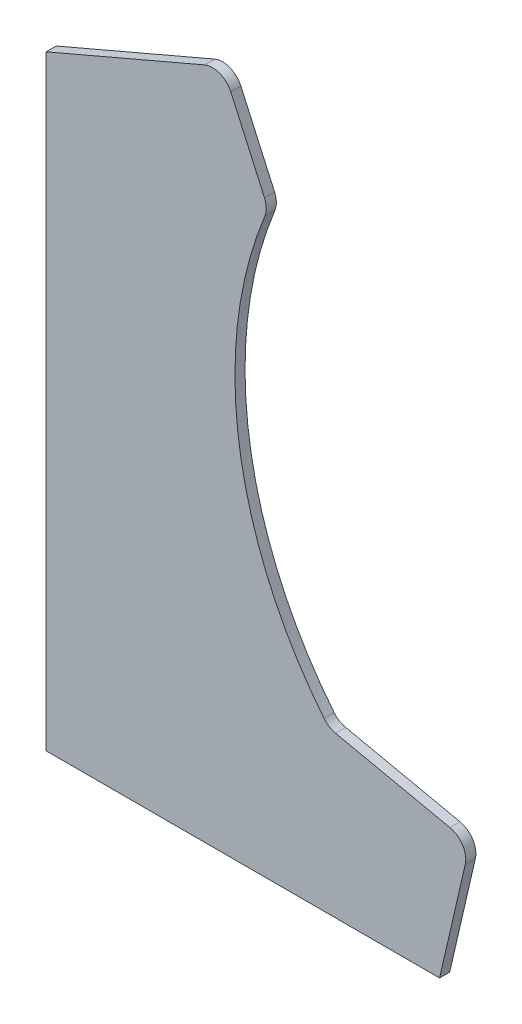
ISO-10303-21;
HEADER;
FILE_DESCRIPTION(('STEP AP214'),'2;1');
FILE_NAME('part.step','',(''),(''),'','','');
FILE_SCHEMA(('AUTOMOTIVE_DESIGN { 1 0 10303 214 1 1 1 1 }'));
ENDSEC;
DATA;
#1=APPLICATION_CONTEXT('core data for automotive mechanical design processes');
#2=APPLICATION_PROTOCOL_DEFINITION('international standard','automotive_design',2000,#1);
#3=PRODUCT_CONTEXT('',#1,'mechanical');
#4=PRODUCT('Part','Part','',(#3));
#5=PRODUCT_RELATED_PRODUCT_CATEGORY('part','',(#4));
#6=PRODUCT_DEFINITION_FORMATION('','',#4);
#7=PRODUCT_DEFINITION_CONTEXT('part definition',#1,'design');
#8=PRODUCT_DEFINITION('design','',#6,#7);
#9=PRODUCT_DEFINITION_SHAPE('','',#8);
#10=(LENGTH_UNIT() NAMED_UNIT(*) SI_UNIT(.MILLI.,.METRE.));
#11=(NAMED_UNIT(*) PLANE_ANGLE_UNIT() SI_UNIT($,.RADIAN.));
#12=(NAMED_UNIT(*) SI_UNIT($,.STERADIAN.) SOLID_ANGLE_UNIT());
#13=UNCERTAINTY_MEASURE_WITH_UNIT(LENGTH_MEASURE(1.E-05),#10,'distance_accuracy_value','');
#14=(GEOMETRIC_REPRESENTATION_CONTEXT(3) GLOBAL_UNCERTAINTY_ASSIGNED_CONTEXT((#13)) GLOBAL_UNIT_ASSIGNED_CONTEXT((#10,
#11,#12)) REPRESENTATION_CONTEXT('',''));
#15=CARTESIAN_POINT('',(0.,0.,0.));
#16=DIRECTION('',(0.,0.,1.));
#17=DIRECTION('',(1.,0.,0.));
#18=AXIS2_PLACEMENT_3D('',#15,#16,#17);
#19=CARTESIAN_POINT('',(390.,0.,10.));
#20=DIRECTION('',(0.,-1.,0.));
#21=DIRECTION('',(1.,0.,0.));
#22=AXIS2_PLACEMENT_3D('',#19,#20,#21);
#23=PLANE('',#22);
#24=DIRECTION('',(-1.,0.,0.));
#25=VECTOR('',#24,1.);
#26=CARTESIAN_POINT('',(390.,0.,0.));
#27=LINE('',#26,#25);
#28=CARTESIAN_POINT('',(390.,0.,0.));
#29=VERTEX_POINT('',#28);
#30=CARTESIAN_POINT('',(0.,0.,0.));
#31=VERTEX_POINT('',#30);
#32=EDGE_CURVE('E159',#29,#31,#27,.T.);
#33=ORIENTED_EDGE('',*,*,#32,.F.);
#34=DIRECTION('',(0.,0.,-1.));
#35=VECTOR('',#34,1.);
#36=CARTESIAN_POINT('',(390.,0.,10.));
#37=LINE('',#36,#35);
#38=CARTESIAN_POINT('',(390.,0.,10.));
#39=VERTEX_POINT('',#38);
#40=EDGE_CURVE('E13',#39,#29,#37,.T.);
#41=ORIENTED_EDGE('',*,*,#40,.F.);
#42=DIRECTION('',(-1.,0.,0.));
#43=VECTOR('',#42,1.);
#44=CARTESIAN_POINT('',(390.,0.,10.));
#45=LINE('',#44,#43);
#46=CARTESIAN_POINT('',(0.,0.,10.));
#47=VERTEX_POINT('',#46);
#48=EDGE_CURVE('E186',#39,#47,#45,.T.);
#49=ORIENTED_EDGE('',*,*,#48,.T.);
#50=DIRECTION('',(0.,0.,-1.));
#51=VECTOR('',#50,1.);
#52=CARTESIAN_POINT('',(0.,0.,10.));
#53=LINE('',#52,#51);
#54=EDGE_CURVE('E45',#47,#31,#53,.T.);
#55=ORIENTED_EDGE('',*,*,#54,.T.);
#56=EDGE_LOOP('',(#33,#41,#49,#55));
#57=FACE_BOUND('',#56,.T.);
#58=ADVANCED_FACE('F42',(#57),#23,.T.);
#59=CARTESIAN_POINT('',(390.,0.,10.));
#60=DIRECTION('',(-0.97439119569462,0.224859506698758,0.));
#61=DIRECTION('',(-0.224859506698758,-0.97439119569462,0.));
#62=AXIS2_PLACEMENT_3D('',#59,#60,#61);
#63=PLANE('',#62);
#64=DIRECTION('',(0.224859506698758,0.97439119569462,0.));
#65=VECTOR('',#64,1.);
#66=CARTESIAN_POINT('',(390.,0.,0.));
#67=LINE('',#66,#65);
#68=CARTESIAN_POINT('',(415.431618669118,110.20368089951,0.));
#69=VERTEX_POINT('',#68);
#70=EDGE_CURVE('E96',#29,#69,#67,.T.);
#71=ORIENTED_EDGE('',*,*,#70,.T.);
#72=DIRECTION('',(0.,0.,-1.));
#73=VECTOR('',#72,1.);
#74=CARTESIAN_POINT('',(415.431618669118,110.20368089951,10.));
#75=LINE('',#74,#73);
#76=CARTESIAN_POINT('',(415.431618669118,110.20368089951,10.));
#77=VERTEX_POINT('',#76);
#78=EDGE_CURVE('E51',#77,#69,#75,.T.);
#79=ORIENTED_EDGE('',*,*,#78,.F.);
#80=DIRECTION('',(0.224859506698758,0.97439119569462,0.));
#81=VECTOR('',#80,1.);
#82=CARTESIAN_POINT('',(390.,0.,10.));
#83=LINE('',#82,#81);
#84=EDGE_CURVE('E137',#39,#77,#83,.T.);
#85=ORIENTED_EDGE('',*,*,#84,.F.);
#86=ORIENTED_EDGE('',*,*,#40,.T.);
#87=EDGE_LOOP('',(#71,#79,#85,#86));
#88=FACE_BOUND('',#87,.T.);
#89=ADVANCED_FACE('F251',(#88),#63,.F.);
#90=CARTESIAN_POINT('',(395.943794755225,114.700871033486,10.));
#91=DIRECTION('',(0.,0.,-1.));
#92=DIRECTION('',(-1.,0.,0.));
#93=AXIS2_PLACEMENT_3D('',#90,#91,#92);
#94=CYLINDRICAL_SURFACE('',#93,20.);
#95=CARTESIAN_POINT('',(395.943794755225,114.700871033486,0.));
#96=DIRECTION('',(0.,0.,1.));
#97=DIRECTION('',(1.,0.,0.));
#98=AXIS2_PLACEMENT_3D('',#95,#96,#97);
#99=CIRCLE('',#98,20.);
#100=CARTESIAN_POINT('',(400.134376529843,134.256919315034,0.));
#101=VERTEX_POINT('',#100);
#102=EDGE_CURVE('E144',#69,#101,#99,.T.);
#103=ORIENTED_EDGE('',*,*,#102,.T.);
#104=DIRECTION('',(0.,0.,-1.));
#105=VECTOR('',#104,1.);
#106=CARTESIAN_POINT('',(400.134376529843,134.256919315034,10.));
#107=LINE('',#106,#105);
#108=CARTESIAN_POINT('',(400.134376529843,134.256919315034,10.));
#109=VERTEX_POINT('',#108);
#110=EDGE_CURVE('E141',#109,#101,#107,.T.);
#111=ORIENTED_EDGE('',*,*,#110,.F.);
#112=CARTESIAN_POINT('',(395.943794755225,114.700871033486,10.));
#113=DIRECTION('',(0.,0.,1.));
#114=DIRECTION('',(1.,0.,0.));
#115=AXIS2_PLACEMENT_3D('',#112,#113,#114);
#116=CIRCLE('',#115,20.);
#117=EDGE_CURVE('E129',#77,#109,#116,.T.);
#118=ORIENTED_EDGE('',*,*,#117,.F.);
#119=ORIENTED_EDGE('',*,*,#78,.T.);
#120=EDGE_LOOP('',(#103,#111,#118,#119));
#121=FACE_BOUND('',#120,.T.);
#122=ADVANCED_FACE('F142',(#121),#94,.T.);
#123=CARTESIAN_POINT('',(400.134376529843,134.256919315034,10.));
#124=DIRECTION('',(-0.209529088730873,-0.97780241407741,0.));
#125=DIRECTION('',(0.97780241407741,-0.209529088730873,0.));
#126=AXIS2_PLACEMENT_3D('',#123,#124,#125);
#127=PLANE('',#126);
#128=DIRECTION('',(-0.97780241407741,0.209529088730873,0.));
#129=VECTOR('',#128,1.);
#130=CARTESIAN_POINT('',(400.134376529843,134.256919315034,0.));
#131=LINE('',#130,#129);
#132=CARTESIAN_POINT('',(286.843759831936,158.533480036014,0.));
#133=VERTEX_POINT('',#132);
#134=EDGE_CURVE('E183',#101,#133,#131,.T.);
#135=ORIENTED_EDGE('',*,*,#134,.T.);
#136=DIRECTION('',(0.,0.,-1.));
#137=VECTOR('',#136,1.);
#138=CARTESIAN_POINT('',(286.843759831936,158.533480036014,10.));
#139=LINE('',#138,#137);
#140=CARTESIAN_POINT('',(286.843759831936,158.533480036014,10.));
#141=VERTEX_POINT('',#140);
#142=EDGE_CURVE('E148',#141,#133,#139,.T.);
#143=ORIENTED_EDGE('',*,*,#142,.F.);
#144=DIRECTION('',(-0.97780241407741,0.209529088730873,0.));
#145=VECTOR('',#144,1.);
#146=CARTESIAN_POINT('',(400.134376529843,134.256919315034,10.));
#147=LINE('',#146,#145);
#148=EDGE_CURVE('E135',#109,#141,#147,.T.);
#149=ORIENTED_EDGE('',*,*,#148,.F.);
#150=ORIENTED_EDGE('',*,*,#110,.T.);
#151=EDGE_LOOP('',(#135,#143,#149,#150));
#152=FACE_BOUND('',#151,.T.);
#153=ADVANCED_FACE('F150',(#152),#127,.F.);
#154=CARTESIAN_POINT('',(291.034341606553,178.089528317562,10.));
#155=DIRECTION('',(0.,0.,-1.));
#156=DIRECTION('',(-1.,0.,0.));
#157=AXIS2_PLACEMENT_3D('',#154,#155,#156);
#158=CYLINDRICAL_SURFACE('',#157,19.9999999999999);
#159=CARTESIAN_POINT('',(291.034341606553,178.089528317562,0.));
#160=DIRECTION('',(0.,0.,1.));
#161=DIRECTION('',(1.,0.,0.));
#162=AXIS2_PLACEMENT_3D('',#159,#160,#161);
#163=CIRCLE('',#162,19.9999999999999);
#164=CARTESIAN_POINT('',(275.449490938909,165.555078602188,0.));
#165=VERTEX_POINT('',#164);
#166=EDGE_CURVE('E180',#165,#133,#163,.T.);
#167=ORIENTED_EDGE('',*,*,#166,.F.);
#168=DIRECTION('',(0.,0.,-1.));
#169=VECTOR('',#168,1.);
#170=CARTESIAN_POINT('',(275.449490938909,165.555078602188,10.));
#171=LINE('',#170,#169);
#172=CARTESIAN_POINT('',(275.449490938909,165.555078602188,10.));
#173=VERTEX_POINT('',#172);
#174=EDGE_CURVE('E190',#173,#165,#171,.T.);
#175=ORIENTED_EDGE('',*,*,#174,.F.);
#176=CARTESIAN_POINT('',(291.034341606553,178.089528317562,10.));
#177=DIRECTION('',(0.,0.,1.));
#178=DIRECTION('',(1.,0.,0.));
#179=AXIS2_PLACEMENT_3D('',#176,#177,#178);
#180=CIRCLE('',#179,19.9999999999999);
#181=EDGE_CURVE('E152',#173,#141,#180,.T.);
#182=ORIENTED_EDGE('',*,*,#181,.T.);
#183=ORIENTED_EDGE('',*,*,#142,.T.);
#184=EDGE_LOOP('',(#167,#175,#182,#183));
#185=FACE_BOUND('',#184,.T.);
#186=ADVANCED_FACE('F207',(#185),#158,.F.);
#187=CARTESIAN_POINT('',(587.146504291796,416.244072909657,10.));
#188=DIRECTION('',(0.,0.,-1.));
#189=DIRECTION('',(-1.,0.,0.));
#190=AXIS2_PLACEMENT_3D('',#187,#188,#189);
#191=CYLINDRICAL_SURFACE('',#190,400.);
#192=CARTESIAN_POINT('',(587.146504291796,416.244072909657,0.));
#193=DIRECTION('',(0.,0.,1.));
#194=DIRECTION('',(1.,0.,0.));
#195=AXIS2_PLACEMENT_3D('',#192,#193,#194);
#196=CIRCLE('',#195,400.);
#197=CARTESIAN_POINT('',(216.714823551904,567.175745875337,0.));
#198=VERTEX_POINT('',#197);
#199=EDGE_CURVE('E177',#198,#165,#196,.T.);
#200=ORIENTED_EDGE('',*,*,#199,.F.);
#201=DIRECTION('',(0.,0.,-1.));
#202=VECTOR('',#201,1.);
#203=CARTESIAN_POINT('',(216.714823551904,567.175745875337,10.));
#204=LINE('',#203,#202);
#205=CARTESIAN_POINT('',(216.714823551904,567.175745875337,10.));
#206=VERTEX_POINT('',#205);
#207=EDGE_CURVE('E192',#206,#198,#204,.T.);
#208=ORIENTED_EDGE('',*,*,#207,.F.);
#209=CARTESIAN_POINT('',(587.146504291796,416.244072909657,10.));
#210=DIRECTION('',(0.,0.,1.));
#211=DIRECTION('',(1.,0.,0.));
#212=AXIS2_PLACEMENT_3D('',#209,#210,#211);
#213=CIRCLE('',#212,400.);
#214=EDGE_CURVE('E154',#206,#173,#213,.T.);
#215=ORIENTED_EDGE('',*,*,#214,.T.);
#216=ORIENTED_EDGE('',*,*,#174,.T.);
#217=EDGE_LOOP('',(#200,#208,#215,#216));
#218=FACE_BOUND('',#217,.T.);
#219=ADVANCED_FACE('F213',(#218),#191,.F.);
#220=CARTESIAN_POINT('',(198.193239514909,574.722329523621,10.));
#221=DIRECTION('',(0.,0.,-1.));
#222=DIRECTION('',(-1.,0.,0.));
#223=AXIS2_PLACEMENT_3D('',#220,#221,#222);
#224=CYLINDRICAL_SURFACE('',#223,20.);
#225=CARTESIAN_POINT('',(198.193239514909,574.722329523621,0.));
#226=DIRECTION('',(0.,0.,-1.));
#227=DIRECTION('',(-1.,0.,0.));
#228=AXIS2_PLACEMENT_3D('',#225,#226,#227);
#229=CIRCLE('',#228,20.);
#230=CARTESIAN_POINT('',(216.431669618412,582.929623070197,0.));
#231=VERTEX_POINT('',#230);
#232=EDGE_CURVE('E174',#231,#198,#229,.T.);
#233=ORIENTED_EDGE('',*,*,#232,.F.);
#234=DIRECTION('',(0.,0.,-1.));
#235=VECTOR('',#234,1.);
#236=CARTESIAN_POINT('',(216.431669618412,582.929623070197,10.));
#237=LINE('',#236,#235);
#238=CARTESIAN_POINT('',(216.431669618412,582.929623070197,10.));
#239=VERTEX_POINT('',#238);
#240=EDGE_CURVE('E194',#239,#231,#237,.T.);
#241=ORIENTED_EDGE('',*,*,#240,.F.);
#242=CARTESIAN_POINT('',(198.193239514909,574.722329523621,10.));
#243=DIRECTION('',(0.,0.,-1.));
#244=DIRECTION('',(-1.,0.,0.));
#245=AXIS2_PLACEMENT_3D('',#242,#243,#244);
#246=CIRCLE('',#245,20.);
#247=EDGE_CURVE('E214',#239,#206,#246,.T.);
#248=ORIENTED_EDGE('',*,*,#247,.T.);
#249=ORIENTED_EDGE('',*,*,#207,.T.);
#250=EDGE_LOOP('',(#233,#241,#248,#249));
#251=FACE_BOUND('',#250,.T.);
#252=ADVANCED_FACE('F241',(#251),#224,.T.);
#253=CARTESIAN_POINT('',(183.061181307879,657.086263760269,10.));
#254=DIRECTION('',(0.911921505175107,0.410364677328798,0.));
#255=DIRECTION('',(-0.410364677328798,0.911921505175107,0.));
#256=AXIS2_PLACEMENT_3D('',#253,#254,#255);
#257=PLANE('',#256);
#258=DIRECTION('',(0.410364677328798,-0.911921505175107,0.));
#259=VECTOR('',#258,1.);
#260=CARTESIAN_POINT('',(183.061181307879,657.086263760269,0.));
#261=LINE('',#260,#259);
#262=CARTESIAN_POINT('',(183.061181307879,657.086263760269,0.));
#263=VERTEX_POINT('',#262);
#264=EDGE_CURVE('E171',#263,#231,#261,.T.);
#265=ORIENTED_EDGE('',*,*,#264,.F.);
#266=DIRECTION('',(0.,0.,-1.));
#267=VECTOR('',#266,1.);
#268=CARTESIAN_POINT('',(183.061181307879,657.086263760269,10.));
#269=LINE('',#268,#267);
#270=CARTESIAN_POINT('',(183.061181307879,657.086263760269,10.));
#271=VERTEX_POINT('',#270);
#272=EDGE_CURVE('E196',#271,#263,#269,.T.);
#273=ORIENTED_EDGE('',*,*,#272,.F.);
#274=DIRECTION('',(0.410364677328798,-0.911921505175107,0.));
#275=VECTOR('',#274,1.);
#276=CARTESIAN_POINT('',(183.061181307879,657.086263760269,10.));
#277=LINE('',#276,#275);
#278=EDGE_CURVE('E215',#271,#239,#277,.T.);
#279=ORIENTED_EDGE('',*,*,#278,.T.);
#280=ORIENTED_EDGE('',*,*,#240,.T.);
#281=EDGE_LOOP('',(#265,#273,#279,#280));
#282=FACE_BOUND('',#281,.T.);
#283=ADVANCED_FACE('F238',(#282),#257,.T.);
#284=CARTESIAN_POINT('',(164.822751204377,648.878970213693,10.));
#285=DIRECTION('',(0.,0.,-1.));
#286=DIRECTION('',(-1.,0.,0.));
#287=AXIS2_PLACEMENT_3D('',#284,#285,#286);
#288=CYLINDRICAL_SURFACE('',#287,20.);
#289=CARTESIAN_POINT('',(164.822751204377,648.878970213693,0.));
#290=DIRECTION('',(0.,0.,-1.));
#291=DIRECTION('',(-1.,0.,0.));
#292=AXIS2_PLACEMENT_3D('',#289,#290,#291);
#293=CIRCLE('',#292,20.);
#294=CARTESIAN_POINT('',(156.944365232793,667.261870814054,0.));
#295=VERTEX_POINT('',#294);
#296=EDGE_CURVE('E168',#295,#263,#293,.T.);
#297=ORIENTED_EDGE('',*,*,#296,.F.);
#298=DIRECTION('',(0.,0.,-1.));
#299=VECTOR('',#298,1.);
#300=CARTESIAN_POINT('',(156.944365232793,667.261870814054,10.));
#301=LINE('',#300,#299);
#302=CARTESIAN_POINT('',(156.944365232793,667.261870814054,10.));
#303=VERTEX_POINT('',#302);
#304=EDGE_CURVE('E198',#303,#295,#301,.T.);
#305=ORIENTED_EDGE('',*,*,#304,.F.);
#306=CARTESIAN_POINT('',(164.822751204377,648.878970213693,10.));
#307=DIRECTION('',(0.,0.,-1.));
#308=DIRECTION('',(-1.,0.,0.));
#309=AXIS2_PLACEMENT_3D('',#306,#307,#308);
#310=CIRCLE('',#309,20.);
#311=EDGE_CURVE('E220',#303,#271,#310,.T.);
#312=ORIENTED_EDGE('',*,*,#311,.T.);
#313=ORIENTED_EDGE('',*,*,#272,.T.);
#314=EDGE_LOOP('',(#297,#305,#312,#313));
#315=FACE_BOUND('',#314,.T.);
#316=ADVANCED_FACE('F236',(#315),#288,.T.);
#317=CARTESIAN_POINT('',(0.,600.,10.));
#318=DIRECTION('',(-0.393919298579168,0.919145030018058,0.));
#319=DIRECTION('',(-0.919145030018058,-0.393919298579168,0.));
#320=AXIS2_PLACEMENT_3D('',#317,#318,#319);
#321=PLANE('',#320);
#322=DIRECTION('',(0.919145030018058,0.393919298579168,0.));
#323=VECTOR('',#322,1.);
#324=CARTESIAN_POINT('',(0.,600.,0.));
#325=LINE('',#324,#323);
#326=CARTESIAN_POINT('',(0.,600.,0.));
#327=VERTEX_POINT('',#326);
#328=EDGE_CURVE('E165',#327,#295,#325,.T.);
#329=ORIENTED_EDGE('',*,*,#328,.F.);
#330=DIRECTION('',(0.,0.,-1.));
#331=VECTOR('',#330,1.);
#332=CARTESIAN_POINT('',(0.,600.,10.));
#333=LINE('',#332,#331);
#334=CARTESIAN_POINT('',(0.,600.,10.));
#335=VERTEX_POINT('',#334);
#336=EDGE_CURVE('E199',#335,#327,#333,.T.);
#337=ORIENTED_EDGE('',*,*,#336,.F.);
#338=DIRECTION('',(0.919145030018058,0.393919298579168,0.));
#339=VECTOR('',#338,1.);
#340=CARTESIAN_POINT('',(0.,600.,10.));
#341=LINE('',#340,#339);
#342=EDGE_CURVE('E223',#335,#303,#341,.T.);
#343=ORIENTED_EDGE('',*,*,#342,.T.);
#344=ORIENTED_EDGE('',*,*,#304,.T.);
#345=EDGE_LOOP('',(#329,#337,#343,#344));
#346=FACE_BOUND('',#345,.T.);
#347=ADVANCED_FACE('F232',(#346),#321,.T.);
#348=CARTESIAN_POINT('',(0.,0.,10.));
#349=DIRECTION('',(-1.,0.,0.));
#350=DIRECTION('',(0.,0.,1.));
#351=AXIS2_PLACEMENT_3D('',#348,#349,#350);
#352=PLANE('',#351);
#353=DIRECTION('',(0.,1.,0.));
#354=VECTOR('',#353,1.);
#355=CARTESIAN_POINT('',(0.,0.,0.));
#356=LINE('',#355,#354);
#357=EDGE_CURVE('E162',#31,#327,#356,.T.);
#358=ORIENTED_EDGE('',*,*,#357,.F.);
#359=ORIENTED_EDGE('',*,*,#54,.F.);
#360=DIRECTION('',(0.,1.,0.));
#361=VECTOR('',#360,1.);
#362=CARTESIAN_POINT('',(0.,0.,10.));
#363=LINE('',#362,#361);
#364=EDGE_CURVE('E226',#47,#335,#363,.T.);
#365=ORIENTED_EDGE('',*,*,#364,.T.);
#366=ORIENTED_EDGE('',*,*,#336,.T.);
#367=EDGE_LOOP('',(#358,#359,#365,#366));
#368=FACE_BOUND('',#367,.T.);
#369=ADVANCED_FACE('F201',(#368),#352,.T.);
#370=CARTESIAN_POINT('',(164.822751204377,648.878970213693,10.));
#371=DIRECTION('',(0.,0.,-1.));
#372=DIRECTION('',(-1.,0.,0.));
#373=AXIS2_PLACEMENT_3D('',#370,#371,#372);
#374=PLANE('',#373);
#375=ORIENTED_EDGE('',*,*,#48,.F.);
#376=ORIENTED_EDGE('',*,*,#84,.T.);
#377=ORIENTED_EDGE('',*,*,#117,.T.);
#378=ORIENTED_EDGE('',*,*,#148,.T.);
#379=ORIENTED_EDGE('',*,*,#181,.F.);
#380=ORIENTED_EDGE('',*,*,#214,.F.);
#381=ORIENTED_EDGE('',*,*,#247,.F.);
#382=ORIENTED_EDGE('',*,*,#278,.F.);
#383=ORIENTED_EDGE('',*,*,#311,.F.);
#384=ORIENTED_EDGE('',*,*,#342,.F.);
#385=ORIENTED_EDGE('',*,*,#364,.F.);
#386=EDGE_LOOP('',(#375,#376,#377,#378,#379,#380,#381,#382,#383,#384,#385));
#387=FACE_BOUND('',#386,.T.);
#388=ADVANCED_FACE('F132',(#387),#374,.F.);
#389=CARTESIAN_POINT('',(164.822751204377,648.878970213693,0.));
#390=DIRECTION('',(0.,0.,-1.));
#391=DIRECTION('',(-1.,0.,0.));
#392=AXIS2_PLACEMENT_3D('',#389,#390,#391);
#393=PLANE('',#392);
#394=ORIENTED_EDGE('',*,*,#32,.T.);
#395=ORIENTED_EDGE('',*,*,#357,.T.);
#396=ORIENTED_EDGE('',*,*,#328,.T.);
#397=ORIENTED_EDGE('',*,*,#296,.T.);
#398=ORIENTED_EDGE('',*,*,#264,.T.);
#399=ORIENTED_EDGE('',*,*,#232,.T.);
#400=ORIENTED_EDGE('',*,*,#199,.T.);
#401=ORIENTED_EDGE('',*,*,#166,.T.);
#402=ORIENTED_EDGE('',*,*,#134,.F.);
#403=ORIENTED_EDGE('',*,*,#102,.F.);
#404=ORIENTED_EDGE('',*,*,#70,.F.);
#405=EDGE_LOOP('',(#394,#395,#396,#397,#398,#399,#400,#401,#402,#403,#404));
#406=FACE_BOUND('',#405,.T.);
#407=ADVANCED_FACE('F203',(#406),#393,.T.);
#408=CLOSED_SHELL('',(#58,#89,#122,#153,#186,#219,#252,#283,#316,#347,#369,#388,#407));
#409=MANIFOLD_SOLID_BREP('B2',#408);
#410=ADVANCED_BREP_SHAPE_REPRESENTATION('',(#18,#409),#14);
#411=SHAPE_DEFINITION_REPRESENTATION(#9,#410);
ENDSEC;
END-ISO-10303-21;
